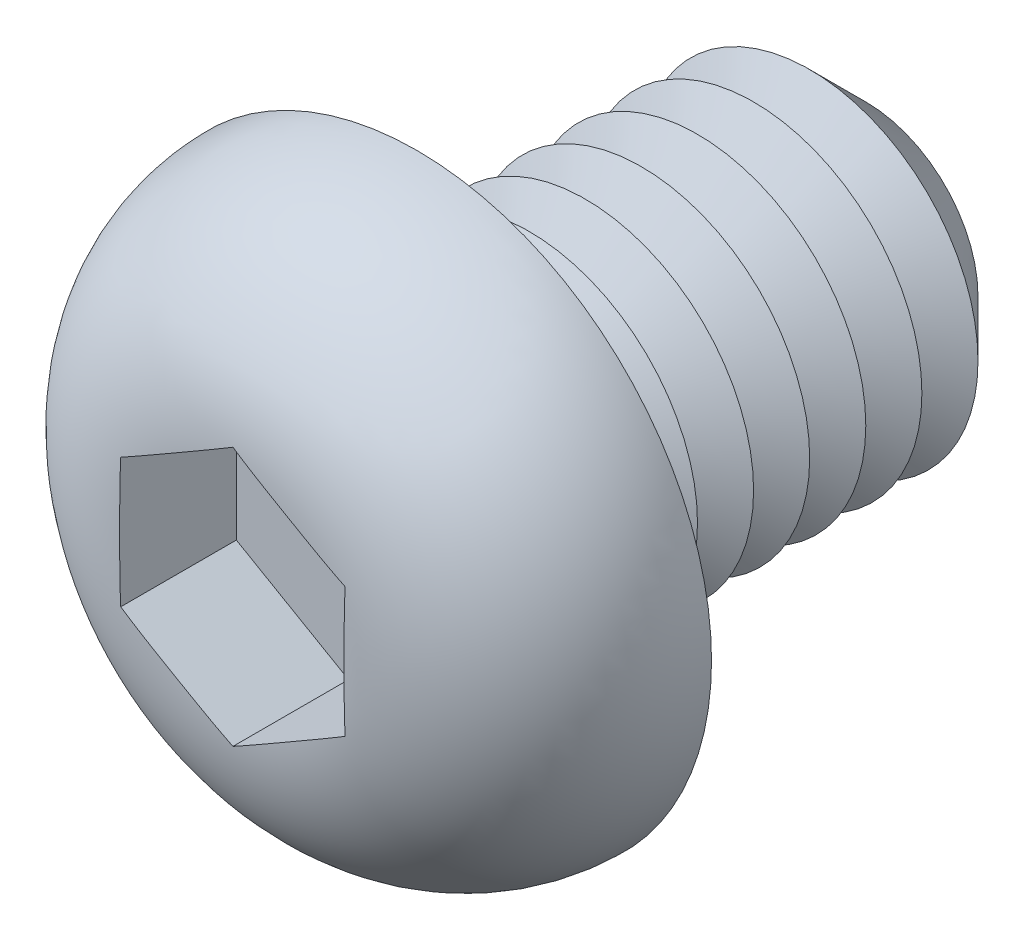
ISO-10303-21;
HEADER;
FILE_DESCRIPTION(('STEP AP214'),'2;1');
FILE_NAME('part.step','',(''),(''),'','','');
FILE_SCHEMA(('AUTOMOTIVE_DESIGN { 1 0 10303 214 1 1 1 1 }'));
ENDSEC;
DATA;
#1=APPLICATION_CONTEXT('core data for automotive mechanical design processes');
#2=APPLICATION_PROTOCOL_DEFINITION('international standard','automotive_design',2000,#1);
#3=PRODUCT_CONTEXT('',#1,'mechanical');
#4=PRODUCT('Part','Part','',(#3));
#5=PRODUCT_RELATED_PRODUCT_CATEGORY('part','',(#4));
#6=PRODUCT_DEFINITION_FORMATION('','',#4);
#7=PRODUCT_DEFINITION_CONTEXT('part definition',#1,'design');
#8=PRODUCT_DEFINITION('design','',#6,#7);
#9=PRODUCT_DEFINITION_SHAPE('','',#8);
#10=(LENGTH_UNIT() NAMED_UNIT(*) SI_UNIT(.MILLI.,.METRE.));
#11=(NAMED_UNIT(*) PLANE_ANGLE_UNIT() SI_UNIT($,.RADIAN.));
#12=(NAMED_UNIT(*) SI_UNIT($,.STERADIAN.) SOLID_ANGLE_UNIT());
#13=UNCERTAINTY_MEASURE_WITH_UNIT(LENGTH_MEASURE(1.E-05),#10,'distance_accuracy_value','');
#14=(GEOMETRIC_REPRESENTATION_CONTEXT(3) GLOBAL_UNCERTAINTY_ASSIGNED_CONTEXT((#13)) GLOBAL_UNIT_ASSIGNED_CONTEXT((#10,
#11,#12)) REPRESENTATION_CONTEXT('',''));
#15=CARTESIAN_POINT('',(0.,0.,0.));
#16=DIRECTION('',(0.,0.,1.));
#17=DIRECTION('',(1.,0.,0.));
#18=AXIS2_PLACEMENT_3D('',#15,#16,#17);
#19=CARTESIAN_POINT('',(0.,0.,-8.));
#20=DIRECTION('',(0.,0.,1.));
#21=DIRECTION('',(1.,0.,0.));
#22=AXIS2_PLACEMENT_3D('',#19,#20,#21);
#23=CYLINDRICAL_SURFACE('',#22,3.);
#24=CARTESIAN_POINT('',(0.,0.,-0.5));
#25=DIRECTION('',(0.,0.,1.));
#26=DIRECTION('',(1.,0.,0.));
#27=AXIS2_PLACEMENT_3D('',#24,#25,#26);
#28=CIRCLE('',#27,3.);
#29=CARTESIAN_POINT('',(3.,0.,-0.5));
#30=VERTEX_POINT('',#29);
#31=EDGE_CURVE('E48',#30,#30,#28,.F.);
#32=ORIENTED_EDGE('',*,*,#31,.T.);
#33=EDGE_LOOP('',(#32));
#34=FACE_BOUND('',#33,.T.);
#35=CARTESIAN_POINT('',(0.,0.,-1.));
#36=DIRECTION('',(0.,0.,1.));
#37=DIRECTION('',(1.,0.,0.));
#38=AXIS2_PLACEMENT_3D('',#35,#36,#37);
#39=CIRCLE('',#38,3.);
#40=CARTESIAN_POINT('',(3.,0.,-1.));
#41=VERTEX_POINT('',#40);
#42=EDGE_CURVE('E118',#41,#41,#39,.T.);
#43=ORIENTED_EDGE('',*,*,#42,.T.);
#44=EDGE_LOOP('',(#43));
#45=FACE_BOUND('',#44,.T.);
#46=ADVANCED_FACE('F39',(#34,#45),#23,.T.);
#47=CARTESIAN_POINT('',(0.,5.25,0.));
#48=DIRECTION('',(0.,0.,1.));
#49=DIRECTION('',(1.,0.,0.));
#50=AXIS2_PLACEMENT_3D('',#47,#48,#49);
#51=PLANE('',#50);
#52=CARTESIAN_POINT('',(0.,0.,0.));
#53=DIRECTION('',(0.,0.,1.));
#54=DIRECTION('',(1.,0.,0.));
#55=AXIS2_PLACEMENT_3D('',#52,#53,#54);
#56=CIRCLE('',#55,3.5);
#57=CARTESIAN_POINT('',(3.5,0.,0.));
#58=VERTEX_POINT('',#57);
#59=EDGE_CURVE('E11',#58,#58,#56,.T.);
#60=ORIENTED_EDGE('',*,*,#59,.T.);
#61=EDGE_LOOP('',(#60));
#62=FACE_BOUND('',#61,.T.);
#63=CARTESIAN_POINT('',(0.,0.,0.));
#64=DIRECTION('',(0.,0.,1.));
#65=DIRECTION('',(1.,0.,0.));
#66=AXIS2_PLACEMENT_3D('',#63,#64,#65);
#67=CIRCLE('',#66,5.25);
#68=CARTESIAN_POINT('',(5.25,0.,0.));
#69=VERTEX_POINT('',#68);
#70=EDGE_CURVE('E142',#69,#69,#67,.T.);
#71=ORIENTED_EDGE('',*,*,#70,.F.);
#72=EDGE_LOOP('',(#71));
#73=FACE_BOUND('',#72,.T.);
#74=ADVANCED_FACE('F219',(#62,#73),#51,.F.);
#75=CARTESIAN_POINT('',(0.,0.,0.));
#76=DIRECTION('',(0.,0.,1.));
#77=DIRECTION('',(1.,0.,0.));
#78=AXIS2_PLACEMENT_3D('',#75,#76,#77);
#79=DEGENERATE_TOROIDAL_SURFACE('',#78,1.95,3.3,.T.);
#80=CARTESIAN_POINT('',(-2.0002,1.15458506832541,3.28035788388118));
#81=CARTESIAN_POINT('',(-1.91691288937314,1.20267090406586,3.28561413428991));
#82=CARTESIAN_POINT('',(-1.83357497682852,1.25078607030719,3.2893341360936));
#83=CARTESIAN_POINT('',(-1.66686712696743,1.34703489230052,3.29467873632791));
#84=CARTESIAN_POINT('',(-1.58349720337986,1.39516854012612,3.29630387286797));
#85=CARTESIAN_POINT('',(-1.4167768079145,1.49142460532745,3.29843721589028));
#86=CARTESIAN_POINT('',(-1.33342633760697,1.53954702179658,3.29894575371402));
#87=CARTESIAN_POINT('',(-1.16671724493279,1.63579656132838,3.29953775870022));
#88=CARTESIAN_POINT('',(-1.0833586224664,1.68392368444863,3.29962119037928));
#89=CARTESIAN_POINT('',(-0.916641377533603,1.78017793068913,3.29962119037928));
#90=CARTESIAN_POINT('',(-0.833282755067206,1.82830505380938,3.29953775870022));
#91=CARTESIAN_POINT('',(-0.666573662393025,1.92455459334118,3.29894575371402));
#92=CARTESIAN_POINT('',(-0.5832231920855,1.97267700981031,3.29843721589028));
#93=CARTESIAN_POINT('',(-0.416502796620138,2.06893307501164,3.29630387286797));
#94=CARTESIAN_POINT('',(-0.333132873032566,2.11706672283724,3.29467873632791));
#95=CARTESIAN_POINT('',(-0.166425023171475,2.21331554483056,3.2893341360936));
#96=CARTESIAN_POINT('',(-0.0830871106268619,2.2614307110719,3.28561413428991));
#97=CARTESIAN_POINT('',(0.000200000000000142,2.30951654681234,3.28035788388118));
#98=B_SPLINE_CURVE_WITH_KNOTS('',3,(#80,#81,#82,#83,#84,#85,#86,#87,#88,#89,#90,#91,#92,#93,#94,
#95,#96,#97),.UNSPECIFIED.,.F.,.F.,(4,2,2,2,2,2,2,2,4),(0.,0.288898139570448,0.577722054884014,
0.866460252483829,1.15522255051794,1.44398484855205,1.73272304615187,2.02154696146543,
2.31044510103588),.UNSPECIFIED.);
#99=CARTESIAN_POINT('',(-2.,1.15470053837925,3.28037053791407));
#100=VERTEX_POINT('',#99);
#101=CARTESIAN_POINT('',(0.,2.3094010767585,3.28037053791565));
#102=VERTEX_POINT('',#101);
#103=EDGE_CURVE('E159',#100,#102,#98,.T.);
#104=ORIENTED_EDGE('',*,*,#103,.T.);
#105=CARTESIAN_POINT('',(-0.000199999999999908,2.30951654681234,3.28035788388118));
#106=CARTESIAN_POINT('',(0.0830871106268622,2.2614307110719,3.28561413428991));
#107=CARTESIAN_POINT('',(0.166425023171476,2.21331554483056,3.2893341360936));
#108=CARTESIAN_POINT('',(0.333132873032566,2.11706672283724,3.29467873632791));
#109=CARTESIAN_POINT('',(0.416502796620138,2.06893307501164,3.29630387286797));
#110=CARTESIAN_POINT('',(0.5832231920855,1.97267700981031,3.29843721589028));
#111=CARTESIAN_POINT('',(0.666573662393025,1.92455459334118,3.29894575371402));
#112=CARTESIAN_POINT('',(0.833282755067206,1.82830505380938,3.29953775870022));
#113=CARTESIAN_POINT('',(0.916641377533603,1.78017793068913,3.29962119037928));
#114=CARTESIAN_POINT('',(1.0833586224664,1.68392368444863,3.29962119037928));
#115=CARTESIAN_POINT('',(1.16671724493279,1.63579656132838,3.29953775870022));
#116=CARTESIAN_POINT('',(1.33342633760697,1.53954702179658,3.29894575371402));
#117=CARTESIAN_POINT('',(1.4167768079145,1.49142460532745,3.29843721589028));
#118=CARTESIAN_POINT('',(1.58349720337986,1.39516854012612,3.29630387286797));
#119=CARTESIAN_POINT('',(1.66686712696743,1.34703489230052,3.29467873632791));
#120=CARTESIAN_POINT('',(1.83357497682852,1.25078607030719,3.2893341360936));
#121=CARTESIAN_POINT('',(1.91691288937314,1.20267090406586,3.28561413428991));
#122=CARTESIAN_POINT('',(2.0002,1.15458506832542,3.28035788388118));
#123=B_SPLINE_CURVE_WITH_KNOTS('',3,(#105,#106,#107,#108,#109,#110,#111,#112,#113,#114,#115,
#116,#117,#118,#119,#120,#121,#122),.UNSPECIFIED.,.F.,.F.,(4,2,2,2,2,2,2,2,4),(0.,
0.288898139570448,0.577722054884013,0.866460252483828,1.15522255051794,1.44398484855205,
1.73272304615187,2.02154696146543,2.31044510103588),.UNSPECIFIED.);
#124=CARTESIAN_POINT('',(2.,1.15470053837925,3.28037053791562));
#125=VERTEX_POINT('',#124);
#126=EDGE_CURVE('E98',#102,#125,#123,.T.);
#127=ORIENTED_EDGE('',*,*,#126,.T.);
#128=CARTESIAN_POINT('',(2.,0.,3.29962119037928));
#129=CARTESIAN_POINT('',(2.,-0.0837769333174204,3.29962202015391));
#130=CARTESIAN_POINT('',(2.,-0.16755385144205,3.29955399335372));
#131=CARTESIAN_POINT('',(2.,-0.335108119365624,3.29913665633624));
#132=CARTESIAN_POINT('',(2.,-0.418885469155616,3.29878734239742));
#133=CARTESIAN_POINT('',(2.,-0.586474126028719,3.29739645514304));
#134=CARTESIAN_POINT('',(2.,-0.670285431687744,3.29635457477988));
#135=CARTESIAN_POINT('',(2.,-0.83788107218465,3.29299045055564));
#136=CARTESIAN_POINT('',(2.,-0.921665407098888,3.29066821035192));
#137=CARTESIAN_POINT('',(2.,-1.1722454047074,3.2807858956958));
#138=CARTESIAN_POINT('',(2.,-1.33895832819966,3.27031526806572));
#139=CARTESIAN_POINT('',(2.,-1.67103623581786,3.23635494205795));
#140=CARTESIAN_POINT('',(2.,-1.83640244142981,3.21287879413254));
#141=CARTESIAN_POINT('',(2.,-2.10344176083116,3.16074182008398));
#142=CARTESIAN_POINT('',(2.,-2.2061099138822,3.13718731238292));
#143=CARTESIAN_POINT('',(2.,-2.40948794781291,3.08263206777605));
#144=CARTESIAN_POINT('',(2.,-2.51019754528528,3.05163026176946));
#145=CARTESIAN_POINT('',(2.,-2.70894468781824,2.98167613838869));
#146=CARTESIAN_POINT('',(2.,-2.80697949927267,2.94271600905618));
#147=CARTESIAN_POINT('',(2.,-2.9994014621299,2.85662314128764));
#148=CARTESIAN_POINT('',(2.,-3.09378880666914,2.80949083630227));
#149=CARTESIAN_POINT('',(2.,-3.27874879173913,2.70660110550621));
#150=CARTESIAN_POINT('',(2.,-3.36928473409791,2.6507774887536));
#151=CARTESIAN_POINT('',(2.,-3.54476824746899,2.53095107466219));
#152=CARTESIAN_POINT('',(2.,-3.6297163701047,2.46694908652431));
#153=CARTESIAN_POINT('',(2.,-3.79309021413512,2.33110056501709));
#154=CARTESIAN_POINT('',(2.,-3.87151694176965,2.25925524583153));
#155=CARTESIAN_POINT('',(2.,-4.02093628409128,2.10826339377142));
#156=CARTESIAN_POINT('',(2.,-4.09192987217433,2.02911781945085));
#157=CARTESIAN_POINT('',(2.,-4.27732278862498,1.8003635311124));
#158=CARTESIAN_POINT('',(2.,-4.38297261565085,1.64348590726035));
#159=CARTESIAN_POINT('',(2.,-4.564185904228,1.31336862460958));
#160=CARTESIAN_POINT('',(2.,-4.63976443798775,1.14013721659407));
#161=CARTESIAN_POINT('',(2.,-4.75417820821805,0.794488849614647));
#162=CARTESIAN_POINT('',(2.,-4.79509243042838,0.622758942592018));
#163=CARTESIAN_POINT('',(2.,-4.84679751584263,0.274828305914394));
#164=CARTESIAN_POINT('',(2.,-4.85759267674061,0.0986282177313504));
#165=CARTESIAN_POINT('',(2.,-4.8487955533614,-0.249157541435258));
#166=CARTESIAN_POINT('',(2.,-4.82985906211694,-0.420760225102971));
#167=CARTESIAN_POINT('',(2.,-4.76345103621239,-0.758322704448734));
#168=CARTESIAN_POINT('',(2.,-4.71598351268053,-0.924283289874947));
#169=CARTESIAN_POINT('',(2.,-4.59404942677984,-1.24604183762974));
#170=CARTESIAN_POINT('',(2.,-4.51956988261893,-1.40183487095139));
#171=CARTESIAN_POINT('',(2.,-4.34600859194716,-1.6990817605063));
#172=CARTESIAN_POINT('',(2.,-4.24691988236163,-1.84053154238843));
#173=CARTESIAN_POINT('',(2.,-4.02493220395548,-2.10847549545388));
#174=CARTESIAN_POINT('',(2.,-3.90156532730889,-2.23458080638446));
#175=CARTESIAN_POINT('',(2.,-3.63636218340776,-2.46550695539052));
#176=CARTESIAN_POINT('',(2.,-3.49453117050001,-2.57033382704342));
#177=CARTESIAN_POINT('',(2.,-3.26713798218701,-2.7130834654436));
#178=CARTESIAN_POINT('',(2.,-3.18660091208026,-2.75923686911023));
#179=CARTESIAN_POINT('',(2.,-3.02216370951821,-2.84520816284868));
#180=CARTESIAN_POINT('',(2.,-2.93826250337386,-2.88502400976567));
#181=CARTESIAN_POINT('',(2.,-2.76779132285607,-2.95832456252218));
#182=CARTESIAN_POINT('',(2.,-2.68122238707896,-2.99181169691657));
#183=CARTESIAN_POINT('',(2.,-2.50604626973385,-3.05263810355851));
#184=CARTESIAN_POINT('',(2.,-2.41744088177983,-3.07998257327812));
#185=CARTESIAN_POINT('',(2.,-2.20396420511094,-3.13835394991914));
#186=CARTESIAN_POINT('',(2.,-2.0783565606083,-3.16669536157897));
#187=CARTESIAN_POINT('',(2.,-1.82529007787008,-3.2134938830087));
#188=CARTESIAN_POINT('',(2.,-1.69783012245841,-3.23194474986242));
#189=CARTESIAN_POINT('',(2.,-1.4414959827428,-3.26083645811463));
#190=CARTESIAN_POINT('',(2.,-1.31261808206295,-3.27124272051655));
#191=CARTESIAN_POINT('',(2.,-1.0545684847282,-3.28623769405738));
#192=CARTESIAN_POINT('',(2.,-0.925396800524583,-3.29082664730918));
#193=CARTESIAN_POINT('',(2.,-0.665550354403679,-3.29674923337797));
#194=CARTESIAN_POINT('',(2.,-0.534874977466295,-3.29804579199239));
#195=CARTESIAN_POINT('',(2.,-0.273526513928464,-3.29947536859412));
#196=CARTESIAN_POINT('',(2.,-0.142853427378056,-3.29960842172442));
#197=CARTESIAN_POINT('',(2.,0.118243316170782,-3.29963281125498));
#198=CARTESIAN_POINT('',(2.,0.24866697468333,-3.29952460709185));
#199=CARTESIAN_POINT('',(2.,0.509509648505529,-3.29825409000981));
#200=CARTESIAN_POINT('',(2.,0.63992866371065,-3.29709183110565));
#201=CARTESIAN_POINT('',(2.,0.831730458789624,-3.29304171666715));
#202=CARTESIAN_POINT('',(2.,0.893136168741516,-3.29139197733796));
#203=CARTESIAN_POINT('',(2.,1.0159128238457,-3.28711504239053));
#204=CARTESIAN_POINT('',(2.,1.07728376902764,-3.28448784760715));
#205=CARTESIAN_POINT('',(2.,1.26131335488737,-3.27473407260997));
#206=CARTESIAN_POINT('',(2.,1.38388698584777,-3.26573532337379));
#207=CARTESIAN_POINT('',(2.,1.627501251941,-3.24079239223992));
#208=CARTESIAN_POINT('',(2.,1.74854662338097,-3.22489680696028));
#209=CARTESIAN_POINT('',(2.,1.98924449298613,-3.18452451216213));
#210=CARTESIAN_POINT('',(2.,2.10889688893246,-3.16004717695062));
#211=CARTESIAN_POINT('',(2.,2.34827145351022,-3.10067973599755));
#212=CARTESIAN_POINT('',(2.,2.46794336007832,-3.06558373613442));
#213=CARTESIAN_POINT('',(2.,2.70350765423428,-2.98433995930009));
#214=CARTESIAN_POINT('',(2.,2.81940009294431,-2.93819233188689));
#215=CARTESIAN_POINT('',(2.,3.0462872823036,-2.83430045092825));
#216=CARTESIAN_POINT('',(2.,3.157267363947,-2.77652399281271));
#217=CARTESIAN_POINT('',(2.,3.37244069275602,-2.64945989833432));
#218=CARTESIAN_POINT('',(2.,3.47663511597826,-2.58017426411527));
#219=CARTESIAN_POINT('',(2.,3.66184410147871,-2.44158969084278));
#220=CARTESIAN_POINT('',(2.,3.74400419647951,-2.37381785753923));
#221=CARTESIAN_POINT('',(2.,3.90136233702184,-2.23063102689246));
#222=CARTESIAN_POINT('',(2.,3.9765614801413,-2.1552172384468));
#223=CARTESIAN_POINT('',(2.,4.11902811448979,-1.99742327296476));
#224=CARTESIAN_POINT('',(2.,4.18630715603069,-1.91505354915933));
#225=CARTESIAN_POINT('',(2.,4.31224227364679,-1.74401295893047));
#226=CARTESIAN_POINT('',(2.,4.37089943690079,-1.65534288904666));
#227=CARTESIAN_POINT('',(2.,4.51742320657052,-1.40720395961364));
#228=CARTESIAN_POINT('',(2.,4.59632371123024,-1.24230503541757));
#229=CARTESIAN_POINT('',(2.,4.72377654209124,-0.901269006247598));
#230=CARTESIAN_POINT('',(2.,4.77233626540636,-0.725134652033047));
#231=CARTESIAN_POINT('',(2.,4.83594291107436,-0.375162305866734));
#232=CARTESIAN_POINT('',(2.,4.85240855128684,-0.201581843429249));
#233=CARTESIAN_POINT('',(2.,4.85558073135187,0.145835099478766));
#234=CARTESIAN_POINT('',(2.,4.8422910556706,0.319671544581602));
#235=CARTESIAN_POINT('',(2.,4.78674180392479,0.6605393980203));
#236=CARTESIAN_POINT('',(2.,4.74482430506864,0.827626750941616));
#237=CARTESIAN_POINT('',(2.,4.63375789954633,1.15246461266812));
#238=CARTESIAN_POINT('',(2.,4.56461058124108,1.31021566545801));
#239=CARTESIAN_POINT('',(2.,4.40063624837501,1.61344814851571));
#240=CARTESIAN_POINT('',(2.,4.30559842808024,1.75881539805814));
#241=CARTESIAN_POINT('',(2.,4.09315528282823,2.03216183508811));
#242=CARTESIAN_POINT('',(2.,3.97574503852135,2.16013718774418));
#243=CARTESIAN_POINT('',(2.,3.71810418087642,2.39975271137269));
#244=CARTESIAN_POINT('',(2.,3.57725563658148,2.51072635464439));
#245=CARTESIAN_POINT('',(2.,3.28005668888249,2.70933274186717));
#246=CARTESIAN_POINT('',(2.,3.12370896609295,2.79696951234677));
#247=CARTESIAN_POINT('',(2.,2.85462284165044,2.92305372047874));
#248=CARTESIAN_POINT('',(2.,2.74490899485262,2.96813077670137));
#249=CARTESIAN_POINT('',(2.,2.52184151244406,3.04824715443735));
#250=CARTESIAN_POINT('',(2.,2.40848685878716,3.08328364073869));
#251=CARTESIAN_POINT('',(2.,2.17918323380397,3.14397693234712));
#252=CARTESIAN_POINT('',(2.,2.06323128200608,3.16962230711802));
#253=CARTESIAN_POINT('',(2.,1.82982653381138,3.21251895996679));
#254=CARTESIAN_POINT('',(2.,1.71237385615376,3.229770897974));
#255=CARTESIAN_POINT('',(2.,1.46252543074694,3.2589582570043));
#256=CARTESIAN_POINT('',(2.,1.3300298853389,3.27000580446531));
#257=CARTESIAN_POINT('',(2.,1.0646774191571,3.28585371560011));
#258=CARTESIAN_POINT('',(2.,0.931820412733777,3.29065244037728));
#259=CARTESIAN_POINT('',(2.,0.665789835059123,3.29677132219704));
#260=CARTESIAN_POINT('',(2.,0.532616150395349,3.29808470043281));
#261=CARTESIAN_POINT('',(2.,0.332868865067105,3.29913679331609));
#262=CARTESIAN_POINT('',(2.,0.266295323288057,3.2993345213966));
#263=CARTESIAN_POINT('',(2.,0.133147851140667,3.29957639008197));
#264=CARTESIAN_POINT('',(2.,0.0665739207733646,3.29962053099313));
#265=CARTESIAN_POINT('',(2.,0.,3.29962119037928));
#266=B_SPLINE_CURVE_WITH_KNOTS('',3,(#128,#129,#130,#131,#132,#133,#134,#135,#136,#137,#138,
#139,#140,#141,#142,#143,#144,#145,#146,#147,#148,#149,#150,#151,#152,#153,#154,#155,#156,#157,
#158,#159,#160,#161,#162,#163,#164,#165,#166,#167,#168,#169,#170,#171,#172,#173,#174,#175,#176,
#177,#178,#179,#180,#181,#182,#183,#184,#185,#186,#187,#188,#189,#190,#191,#192,#193,#194,#195,
#196,#197,#198,#199,#200,#201,#202,#203,#204,#205,#206,#207,#208,#209,#210,#211,#212,#213,#214,
#215,#216,#217,#218,#219,#220,#221,#222,#223,#224,#225,#226,#227,#228,#229,#230,#231,#232,#233,
#234,#235,#236,#237,#238,#239,#240,#241,#242,#243,#244,#245,#246,#247,#248,#249,#250,#251,#252,
#253,#254,#255,#256,#257,#258,#259,#260,#261,#262,#263,#264,#265),.UNSPECIFIED.,.T.,.F.,(4,2,2,
2,2,2,2,2,2,2,2,2,2,2,2,2,2,2,2,2,2,2,2,2,2,2,2,2,2,2,2,2,2,2,2,2,2,2,2,2,2,2,2,2,2,2,2,2,2,2,2,
2,2,2,2,2,2,2,2,2,2,2,2,2,2,2,2,2,4),(0.,0.251330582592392,0.502664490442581,0.754109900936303,
1.00555459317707,1.50637447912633,2.00667353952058,2.32243701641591,2.63824585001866,
2.95436618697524,3.27046976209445,3.58911045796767,3.90771965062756,4.22627959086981,
4.5447977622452,5.10896009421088,5.67283930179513,6.19985685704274,6.72679920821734,
7.24228104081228,7.75769041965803,8.27334782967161,8.78915130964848,9.3160918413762,
9.84288274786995,10.1211212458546,10.3994492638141,10.6776702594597,10.9556549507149,
11.3414617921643,11.727511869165,12.1152122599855,12.5028965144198,12.8949273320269,
13.2869463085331,13.6782193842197,14.0694724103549,14.2537488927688,14.4380252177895,
14.8065831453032,15.1725852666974,15.5386140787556,15.9122523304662,16.28588552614,
16.6605680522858,17.0351854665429,17.3542226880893,17.6732095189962,17.9917252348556,
18.3102007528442,18.8555909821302,19.4008481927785,19.9214008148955,20.4418872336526,
20.9562606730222,21.4706041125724,21.9892675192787,22.5080451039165,23.0436926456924,
23.5792477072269,23.9346277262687,24.2901079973,24.6460195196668,25.0019030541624,
25.4005476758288,25.7992968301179,26.1988209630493,26.3985429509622,26.5982645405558),.UNSPECIFIED.);
#267=CARTESIAN_POINT('',(2.,-1.15470053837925,3.28037053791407));
#268=VERTEX_POINT('',#267);
#269=EDGE_CURVE('E63',#125,#268,#266,.T.);
#270=ORIENTED_EDGE('',*,*,#269,.T.);
#271=CARTESIAN_POINT('',(2.0002,-1.15458506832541,3.28035788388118));
#272=CARTESIAN_POINT('',(1.91691288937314,-1.20267090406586,3.28561413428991));
#273=CARTESIAN_POINT('',(1.83357497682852,-1.25078607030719,3.2893341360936));
#274=CARTESIAN_POINT('',(1.66686712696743,-1.34703489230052,3.29467873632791));
#275=CARTESIAN_POINT('',(1.58349720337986,-1.39516854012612,3.29630387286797));
#276=CARTESIAN_POINT('',(1.4167768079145,-1.49142460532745,3.29843721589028));
#277=CARTESIAN_POINT('',(1.33342633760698,-1.53954702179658,3.29894575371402));
#278=CARTESIAN_POINT('',(1.16671724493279,-1.63579656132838,3.29953775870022));
#279=CARTESIAN_POINT('',(1.0833586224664,-1.68392368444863,3.29962119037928));
#280=CARTESIAN_POINT('',(0.916641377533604,-1.78017793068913,3.29962119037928));
#281=CARTESIAN_POINT('',(0.833282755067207,-1.82830505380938,3.29953775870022));
#282=CARTESIAN_POINT('',(0.666573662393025,-1.92455459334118,3.29894575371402));
#283=CARTESIAN_POINT('',(0.5832231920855,-1.97267700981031,3.29843721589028));
#284=CARTESIAN_POINT('',(0.416502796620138,-2.06893307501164,3.29630387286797));
#285=CARTESIAN_POINT('',(0.333132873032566,-2.11706672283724,3.29467873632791));
#286=CARTESIAN_POINT('',(0.166425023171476,-2.21331554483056,3.2893341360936));
#287=CARTESIAN_POINT('',(0.0830871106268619,-2.2614307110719,3.28561413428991));
#288=CARTESIAN_POINT('',(-0.000199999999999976,-2.30951654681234,3.28035788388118));
#289=B_SPLINE_CURVE_WITH_KNOTS('',3,(#271,#272,#273,#274,#275,#276,#277,#278,#279,#280,#281,
#282,#283,#284,#285,#286,#287,#288),.UNSPECIFIED.,.F.,.F.,(4,2,2,2,2,2,2,2,4),(0.,
0.288898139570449,0.577722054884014,0.866460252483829,1.15522255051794,1.44398484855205,
1.73272304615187,2.02154696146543,2.31044510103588),.UNSPECIFIED.);
#290=CARTESIAN_POINT('',(0.,-2.3094010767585,3.28037053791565));
#291=VERTEX_POINT('',#290);
#292=EDGE_CURVE('E240',#268,#291,#289,.T.);
#293=ORIENTED_EDGE('',*,*,#292,.T.);
#294=CARTESIAN_POINT('',(0.000200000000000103,-2.30951654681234,3.28035788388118));
#295=CARTESIAN_POINT('',(-0.0830871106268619,-2.2614307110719,3.28561413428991));
#296=CARTESIAN_POINT('',(-0.166425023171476,-2.21331554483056,3.2893341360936));
#297=CARTESIAN_POINT('',(-0.333132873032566,-2.11706672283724,3.29467873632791));
#298=CARTESIAN_POINT('',(-0.416502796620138,-2.06893307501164,3.29630387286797));
#299=CARTESIAN_POINT('',(-0.5832231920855,-1.97267700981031,3.29843721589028));
#300=CARTESIAN_POINT('',(-0.666573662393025,-1.92455459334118,3.29894575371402));
#301=CARTESIAN_POINT('',(-0.833282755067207,-1.82830505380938,3.29953775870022));
#302=CARTESIAN_POINT('',(-0.916641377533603,-1.78017793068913,3.29962119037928));
#303=CARTESIAN_POINT('',(-1.0833586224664,-1.68392368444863,3.29962119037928));
#304=CARTESIAN_POINT('',(-1.16671724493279,-1.63579656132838,3.29953775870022));
#305=CARTESIAN_POINT('',(-1.33342633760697,-1.53954702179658,3.29894575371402));
#306=CARTESIAN_POINT('',(-1.4167768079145,-1.49142460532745,3.29843721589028));
#307=CARTESIAN_POINT('',(-1.58349720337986,-1.39516854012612,3.29630387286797));
#308=CARTESIAN_POINT('',(-1.66686712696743,-1.34703489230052,3.29467873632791));
#309=CARTESIAN_POINT('',(-1.83357497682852,-1.25078607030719,3.2893341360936));
#310=CARTESIAN_POINT('',(-1.91691288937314,-1.20267090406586,3.28561413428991));
#311=CARTESIAN_POINT('',(-2.0002,-1.15458506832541,3.28035788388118));
#312=B_SPLINE_CURVE_WITH_KNOTS('',3,(#294,#295,#296,#297,#298,#299,#300,#301,#302,#303,#304,
#305,#306,#307,#308,#309,#310,#311),.UNSPECIFIED.,.F.,.F.,(4,2,2,2,2,2,2,2,4),(0.,
0.288898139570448,0.577722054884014,0.866460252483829,1.15522255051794,1.44398484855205,
1.73272304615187,2.02154696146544,2.31044510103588),.UNSPECIFIED.);
#313=CARTESIAN_POINT('',(-2.,-1.15470053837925,3.28037053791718));
#314=VERTEX_POINT('',#313);
#315=EDGE_CURVE('E246',#291,#314,#312,.T.);
#316=ORIENTED_EDGE('',*,*,#315,.T.);
#317=CARTESIAN_POINT('',(-2.,0.,3.29962119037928));
#318=CARTESIAN_POINT('',(-2.,0.0837769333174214,3.29962202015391));
#319=CARTESIAN_POINT('',(-2.,0.167553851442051,3.29955399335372));
#320=CARTESIAN_POINT('',(-2.,0.335108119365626,3.29913665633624));
#321=CARTESIAN_POINT('',(-2.,0.418885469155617,3.29878734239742));
#322=CARTESIAN_POINT('',(-2.,0.58647412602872,3.29739645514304));
#323=CARTESIAN_POINT('',(-2.,0.670285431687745,3.29635457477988));
#324=CARTESIAN_POINT('',(-2.,0.837881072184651,3.29299045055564));
#325=CARTESIAN_POINT('',(-2.,0.921665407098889,3.29066821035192));
#326=CARTESIAN_POINT('',(-2.,1.1722454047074,3.2807858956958));
#327=CARTESIAN_POINT('',(-2.,1.33895832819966,3.27031526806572));
#328=CARTESIAN_POINT('',(-2.,1.67103623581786,3.23635494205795));
#329=CARTESIAN_POINT('',(-2.,1.83640244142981,3.21287879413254));
#330=CARTESIAN_POINT('',(-2.,2.10344176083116,3.16074182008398));
#331=CARTESIAN_POINT('',(-2.,2.2061099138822,3.13718731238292));
#332=CARTESIAN_POINT('',(-2.,2.40948794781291,3.08263206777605));
#333=CARTESIAN_POINT('',(-2.,2.51019754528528,3.05163026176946));
#334=CARTESIAN_POINT('',(-2.,2.70894468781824,2.98167613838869));
#335=CARTESIAN_POINT('',(-2.,2.80697949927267,2.94271600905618));
#336=CARTESIAN_POINT('',(-2.,2.9994014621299,2.85662314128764));
#337=CARTESIAN_POINT('',(-2.,3.09378880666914,2.80949083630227));
#338=CARTESIAN_POINT('',(-2.,3.27874879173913,2.70660110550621));
#339=CARTESIAN_POINT('',(-2.,3.36928473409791,2.6507774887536));
#340=CARTESIAN_POINT('',(-2.,3.54476824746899,2.53095107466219));
#341=CARTESIAN_POINT('',(-2.,3.6297163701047,2.46694908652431));
#342=CARTESIAN_POINT('',(-2.,3.79309021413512,2.33110056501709));
#343=CARTESIAN_POINT('',(-2.,3.87151694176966,2.25925524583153));
#344=CARTESIAN_POINT('',(-2.,4.02093628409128,2.10826339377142));
#345=CARTESIAN_POINT('',(-2.,4.09192987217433,2.02911781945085));
#346=CARTESIAN_POINT('',(-2.,4.27732278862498,1.8003635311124));
#347=CARTESIAN_POINT('',(-2.,4.38297261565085,1.64348590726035));
#348=CARTESIAN_POINT('',(-2.,4.564185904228,1.31336862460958));
#349=CARTESIAN_POINT('',(-2.,4.63976443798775,1.14013721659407));
#350=CARTESIAN_POINT('',(-2.,4.75417820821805,0.794488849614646));
#351=CARTESIAN_POINT('',(-2.,4.79509243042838,0.622758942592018));
#352=CARTESIAN_POINT('',(-2.,4.84679751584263,0.274828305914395));
#353=CARTESIAN_POINT('',(-2.,4.85759267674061,0.0986282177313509));
#354=CARTESIAN_POINT('',(-2.,4.8487955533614,-0.249157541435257));
#355=CARTESIAN_POINT('',(-2.,4.82985906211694,-0.420760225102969));
#356=CARTESIAN_POINT('',(-2.,4.76345103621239,-0.758322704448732));
#357=CARTESIAN_POINT('',(-2.,4.71598351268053,-0.924283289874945));
#358=CARTESIAN_POINT('',(-2.,4.59404942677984,-1.24604183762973));
#359=CARTESIAN_POINT('',(-2.,4.51956988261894,-1.40183487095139));
#360=CARTESIAN_POINT('',(-2.,4.34600859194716,-1.6990817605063));
#361=CARTESIAN_POINT('',(-2.,4.24691988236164,-1.84053154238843));
#362=CARTESIAN_POINT('',(-2.,4.02493220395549,-2.10847549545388));
#363=CARTESIAN_POINT('',(-2.,3.90156532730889,-2.23458080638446));
#364=CARTESIAN_POINT('',(-2.,3.63636218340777,-2.46550695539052));
#365=CARTESIAN_POINT('',(-2.,3.49453117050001,-2.57033382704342));
#366=CARTESIAN_POINT('',(-2.,3.26713798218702,-2.7130834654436));
#367=CARTESIAN_POINT('',(-2.,3.18660091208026,-2.75923686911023));
#368=CARTESIAN_POINT('',(-2.,3.02216370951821,-2.84520816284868));
#369=CARTESIAN_POINT('',(-2.,2.93826250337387,-2.88502400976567));
#370=CARTESIAN_POINT('',(-2.,2.76779132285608,-2.95832456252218));
#371=CARTESIAN_POINT('',(-2.,2.68122238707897,-2.99181169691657));
#372=CARTESIAN_POINT('',(-2.,2.50604626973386,-3.05263810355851));
#373=CARTESIAN_POINT('',(-2.,2.41744088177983,-3.07998257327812));
#374=CARTESIAN_POINT('',(-2.,2.20396420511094,-3.13835394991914));
#375=CARTESIAN_POINT('',(-2.,2.07835656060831,-3.16669536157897));
#376=CARTESIAN_POINT('',(-2.,1.82529007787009,-3.2134938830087));
#377=CARTESIAN_POINT('',(-2.,1.69783012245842,-3.23194474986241));
#378=CARTESIAN_POINT('',(-2.,1.44149598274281,-3.26083645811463));
#379=CARTESIAN_POINT('',(-2.,1.31261808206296,-3.27124272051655));
#380=CARTESIAN_POINT('',(-2.,1.05456848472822,-3.28623769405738));
#381=CARTESIAN_POINT('',(-2.,0.925396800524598,-3.29082664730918));
#382=CARTESIAN_POINT('',(-2.,0.665550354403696,-3.29674923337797));
#383=CARTESIAN_POINT('',(-2.,0.534874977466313,-3.29804579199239));
#384=CARTESIAN_POINT('',(-2.,0.273526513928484,-3.29947536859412));
#385=CARTESIAN_POINT('',(-2.,0.142853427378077,-3.29960842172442));
#386=CARTESIAN_POINT('',(-2.,-0.118243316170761,-3.29963281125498));
#387=CARTESIAN_POINT('',(-2.,-0.248666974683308,-3.29952460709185));
#388=CARTESIAN_POINT('',(-2.,-0.509509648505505,-3.29825409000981));
#389=CARTESIAN_POINT('',(-2.,-0.639928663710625,-3.29709183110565));
#390=CARTESIAN_POINT('',(-2.,-0.8317304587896,-3.29304171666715));
#391=CARTESIAN_POINT('',(-2.,-0.893136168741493,-3.29139197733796));
#392=CARTESIAN_POINT('',(-2.,-1.01591282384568,-3.28711504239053));
#393=CARTESIAN_POINT('',(-2.,-1.07728376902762,-3.28448784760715));
#394=CARTESIAN_POINT('',(-2.,-1.26131335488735,-3.27473407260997));
#395=CARTESIAN_POINT('',(-2.,-1.38388698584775,-3.2657353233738));
#396=CARTESIAN_POINT('',(-2.,-1.62750125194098,-3.24079239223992));
#397=CARTESIAN_POINT('',(-2.,-1.74854662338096,-3.22489680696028));
#398=CARTESIAN_POINT('',(-2.,-1.98924449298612,-3.18452451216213));
#399=CARTESIAN_POINT('',(-2.,-2.10889688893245,-3.16004717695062));
#400=CARTESIAN_POINT('',(-2.,-2.34827145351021,-3.10067973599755));
#401=CARTESIAN_POINT('',(-2.,-2.46794336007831,-3.06558373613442));
#402=CARTESIAN_POINT('',(-2.,-2.70350765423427,-2.98433995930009));
#403=CARTESIAN_POINT('',(-2.,-2.81940009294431,-2.93819233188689));
#404=CARTESIAN_POINT('',(-2.,-3.0462872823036,-2.83430045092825));
#405=CARTESIAN_POINT('',(-2.,-3.157267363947,-2.77652399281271));
#406=CARTESIAN_POINT('',(-2.,-3.37244069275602,-2.64945989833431));
#407=CARTESIAN_POINT('',(-2.,-3.47663511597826,-2.58017426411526));
#408=CARTESIAN_POINT('',(-2.,-3.66184410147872,-2.44158969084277));
#409=CARTESIAN_POINT('',(-2.,-3.74400419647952,-2.37381785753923));
#410=CARTESIAN_POINT('',(-2.,-3.90136233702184,-2.23063102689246));
#411=CARTESIAN_POINT('',(-2.,-3.9765614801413,-2.1552172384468));
#412=CARTESIAN_POINT('',(-2.,-4.11902811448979,-1.99742327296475));
#413=CARTESIAN_POINT('',(-2.,-4.1863071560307,-1.91505354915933));
#414=CARTESIAN_POINT('',(-2.,-4.31224227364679,-1.74401295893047));
#415=CARTESIAN_POINT('',(-2.,-4.37089943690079,-1.65534288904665));
#416=CARTESIAN_POINT('',(-2.,-4.51742320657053,-1.40720395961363));
#417=CARTESIAN_POINT('',(-2.,-4.59632371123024,-1.24230503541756));
#418=CARTESIAN_POINT('',(-2.,-4.72377654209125,-0.901269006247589));
#419=CARTESIAN_POINT('',(-2.,-4.77233626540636,-0.72513465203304));
#420=CARTESIAN_POINT('',(-2.,-4.83594291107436,-0.375162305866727));
#421=CARTESIAN_POINT('',(-2.,-4.85240855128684,-0.20158184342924));
#422=CARTESIAN_POINT('',(-2.,-4.85558073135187,0.145835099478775));
#423=CARTESIAN_POINT('',(-2.,-4.8422910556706,0.31967154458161));
#424=CARTESIAN_POINT('',(-2.,-4.78674180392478,0.660539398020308));
#425=CARTESIAN_POINT('',(-2.,-4.74482430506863,0.827626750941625));
#426=CARTESIAN_POINT('',(-2.,-4.63375789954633,1.15246461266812));
#427=CARTESIAN_POINT('',(-2.,-4.56461058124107,1.31021566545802));
#428=CARTESIAN_POINT('',(-2.,-4.40063624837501,1.61344814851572));
#429=CARTESIAN_POINT('',(-2.,-4.30559842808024,1.75881539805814));
#430=CARTESIAN_POINT('',(-2.,-4.09315528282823,2.03216183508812));
#431=CARTESIAN_POINT('',(-2.,-3.97574503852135,2.16013718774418));
#432=CARTESIAN_POINT('',(-2.,-3.71810418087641,2.3997527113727));
#433=CARTESIAN_POINT('',(-2.,-3.57725563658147,2.51072635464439));
#434=CARTESIAN_POINT('',(-2.,-3.28005668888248,2.70933274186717));
#435=CARTESIAN_POINT('',(-2.,-3.12370896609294,2.79696951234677));
#436=CARTESIAN_POINT('',(-2.,-2.85462284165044,2.92305372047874));
#437=CARTESIAN_POINT('',(-2.,-2.74490899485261,2.96813077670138));
#438=CARTESIAN_POINT('',(-2.,-2.52184151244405,3.04824715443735));
#439=CARTESIAN_POINT('',(-2.,-2.40848685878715,3.08328364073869));
#440=CARTESIAN_POINT('',(-2.,-2.17918323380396,3.14397693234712));
#441=CARTESIAN_POINT('',(-2.,-2.06323128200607,3.16962230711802));
#442=CARTESIAN_POINT('',(-2.,-1.82982653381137,3.21251895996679));
#443=CARTESIAN_POINT('',(-2.,-1.71237385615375,3.229770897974));
#444=CARTESIAN_POINT('',(-2.,-1.46252543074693,3.2589582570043));
#445=CARTESIAN_POINT('',(-2.,-1.33002988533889,3.27000580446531));
#446=CARTESIAN_POINT('',(-2.,-1.0646774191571,3.28585371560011));
#447=CARTESIAN_POINT('',(-2.,-0.931820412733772,3.29065244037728));
#448=CARTESIAN_POINT('',(-2.,-0.665789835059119,3.29677132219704));
#449=CARTESIAN_POINT('',(-2.,-0.532616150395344,3.29808470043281));
#450=CARTESIAN_POINT('',(-2.,-0.3328688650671,3.29913679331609));
#451=CARTESIAN_POINT('',(-2.,-0.266295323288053,3.2993345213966));
#452=CARTESIAN_POINT('',(-2.,-0.133147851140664,3.29957639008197));
#453=CARTESIAN_POINT('',(-2.,-0.0665739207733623,3.29962053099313));
#454=CARTESIAN_POINT('',(-2.,0.,3.29962119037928));
#455=B_SPLINE_CURVE_WITH_KNOTS('',3,(#317,#318,#319,#320,#321,#322,#323,#324,#325,#326,#327,
#328,#329,#330,#331,#332,#333,#334,#335,#336,#337,#338,#339,#340,#341,#342,#343,#344,#345,#346,
#347,#348,#349,#350,#351,#352,#353,#354,#355,#356,#357,#358,#359,#360,#361,#362,#363,#364,#365,
#366,#367,#368,#369,#370,#371,#372,#373,#374,#375,#376,#377,#378,#379,#380,#381,#382,#383,#384,
#385,#386,#387,#388,#389,#390,#391,#392,#393,#394,#395,#396,#397,#398,#399,#400,#401,#402,#403,
#404,#405,#406,#407,#408,#409,#410,#411,#412,#413,#414,#415,#416,#417,#418,#419,#420,#421,#422,
#423,#424,#425,#426,#427,#428,#429,#430,#431,#432,#433,#434,#435,#436,#437,#438,#439,#440,#441,
#442,#443,#444,#445,#446,#447,#448,#449,#450,#451,#452,#453,#454),.UNSPECIFIED.,.T.,.F.,(4,2,2,
2,2,2,2,2,2,2,2,2,2,2,2,2,2,2,2,2,2,2,2,2,2,2,2,2,2,2,2,2,2,2,2,2,2,2,2,2,2,2,2,2,2,2,2,2,2,2,2,
2,2,2,2,2,2,2,2,2,2,2,2,2,2,2,2,2,4),(0.,0.251330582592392,0.502664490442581,0.754109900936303,
1.00555459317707,1.50637447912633,2.00667353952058,2.32243701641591,2.63824585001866,
2.95436618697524,3.27046976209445,3.58911045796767,3.90771965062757,4.22627959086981,
4.5447977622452,5.10896009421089,5.67283930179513,6.19985685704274,6.72679920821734,
7.24228104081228,7.75769041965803,8.27334782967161,8.78915130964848,9.3160918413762,
9.84288274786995,10.1211212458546,10.3994492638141,10.6776702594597,10.9556549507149,
11.3414617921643,11.727511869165,12.1152122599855,12.5028965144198,12.8949273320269,
13.2869463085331,13.6782193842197,14.0694724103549,14.2537488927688,14.4380252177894,
14.8065831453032,15.1725852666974,15.5386140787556,15.9122523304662,16.28588552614,
16.6605680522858,17.0351854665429,17.3542226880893,17.6732095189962,17.9917252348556,
18.3102007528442,18.8555909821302,19.4008481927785,19.9214008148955,20.4418872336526,
20.9562606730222,21.4706041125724,21.9892675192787,22.5080451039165,23.0436926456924,
23.5792477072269,23.9346277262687,24.2901079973,24.6460195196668,25.0019030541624,
25.4005476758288,25.7992968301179,26.1988209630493,26.3985429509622,26.5982645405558),.UNSPECIFIED.);
#456=EDGE_CURVE('E167',#314,#100,#455,.T.);
#457=ORIENTED_EDGE('',*,*,#456,.T.);
#458=EDGE_LOOP('',(#104,#127,#270,#293,#316,#457));
#459=FACE_BOUND('',#458,.T.);
#460=ORIENTED_EDGE('',*,*,#70,.T.);
#461=EDGE_LOOP('',(#460));
#462=FACE_BOUND('',#461,.T.);
#463=ADVANCED_FACE('F172',(#459,#462),#79,.T.);
#464=CARTESIAN_POINT('',(2.,1.15470053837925,1.22));
#465=DIRECTION('',(0.5,0.866025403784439,0.));
#466=DIRECTION('',(-0.866025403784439,0.5,0.));
#467=AXIS2_PLACEMENT_3D('',#464,#465,#466);
#468=PLANE('',#467);
#469=DIRECTION('',(0.,0.,1.));
#470=VECTOR('',#469,1.);
#471=CARTESIAN_POINT('',(0.,2.3094010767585,1.22));
#472=LINE('',#471,#470);
#473=CARTESIAN_POINT('',(0.,2.3094010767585,1.22));
#474=VERTEX_POINT('',#473);
#475=EDGE_CURVE('E55',#474,#102,#472,.T.);
#476=ORIENTED_EDGE('',*,*,#475,.F.);
#477=DIRECTION('',(-0.866025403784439,0.5,0.));
#478=VECTOR('',#477,1.);
#479=CARTESIAN_POINT('',(2.,1.15470053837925,1.22));
#480=LINE('',#479,#478);
#481=CARTESIAN_POINT('',(2.,1.15470053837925,1.22));
#482=VERTEX_POINT('',#481);
#483=EDGE_CURVE('E95',#482,#474,#480,.T.);
#484=ORIENTED_EDGE('',*,*,#483,.F.);
#485=DIRECTION('',(0.,0.,1.));
#486=VECTOR('',#485,1.);
#487=CARTESIAN_POINT('',(2.,1.15470053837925,1.22));
#488=LINE('',#487,#486);
#489=EDGE_CURVE('E139',#482,#125,#488,.T.);
#490=ORIENTED_EDGE('',*,*,#489,.T.);
#491=ORIENTED_EDGE('',*,*,#126,.F.);
#492=EDGE_LOOP('',(#476,#484,#490,#491));
#493=FACE_BOUND('',#492,.T.);
#494=ADVANCED_FACE('F93',(#493),#468,.F.);
#495=CARTESIAN_POINT('',(2.,-1.15470053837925,1.22));
#496=DIRECTION('',(1.,0.,0.));
#497=DIRECTION('',(0.,1.,0.));
#498=AXIS2_PLACEMENT_3D('',#495,#496,#497);
#499=PLANE('',#498);
#500=ORIENTED_EDGE('',*,*,#489,.F.);
#501=DIRECTION('',(0.,1.,0.));
#502=VECTOR('',#501,1.);
#503=CARTESIAN_POINT('',(2.,-1.15470053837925,1.22));
#504=LINE('',#503,#502);
#505=CARTESIAN_POINT('',(2.,-1.15470053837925,1.22));
#506=VERTEX_POINT('',#505);
#507=EDGE_CURVE('E102',#506,#482,#504,.T.);
#508=ORIENTED_EDGE('',*,*,#507,.F.);
#509=DIRECTION('',(0.,0.,1.));
#510=VECTOR('',#509,1.);
#511=CARTESIAN_POINT('',(2.,-1.15470053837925,1.22));
#512=LINE('',#511,#510);
#513=EDGE_CURVE('E143',#506,#268,#512,.T.);
#514=ORIENTED_EDGE('',*,*,#513,.T.);
#515=ORIENTED_EDGE('',*,*,#269,.F.);
#516=EDGE_LOOP('',(#500,#508,#514,#515));
#517=FACE_BOUND('',#516,.T.);
#518=ADVANCED_FACE('F183',(#517),#499,.F.);
#519=CARTESIAN_POINT('',(0.,-2.3094010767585,1.22));
#520=DIRECTION('',(0.5,-0.866025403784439,0.));
#521=DIRECTION('',(0.866025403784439,0.5,0.));
#522=AXIS2_PLACEMENT_3D('',#519,#520,#521);
#523=PLANE('',#522);
#524=ORIENTED_EDGE('',*,*,#513,.F.);
#525=DIRECTION('',(0.866025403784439,0.5,0.));
#526=VECTOR('',#525,1.);
#527=CARTESIAN_POINT('',(0.,-2.3094010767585,1.22));
#528=LINE('',#527,#526);
#529=CARTESIAN_POINT('',(0.,-2.3094010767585,1.22));
#530=VERTEX_POINT('',#529);
#531=EDGE_CURVE('E134',#530,#506,#528,.T.);
#532=ORIENTED_EDGE('',*,*,#531,.F.);
#533=DIRECTION('',(0.,0.,1.));
#534=VECTOR('',#533,1.);
#535=CARTESIAN_POINT('',(0.,-2.3094010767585,1.22));
#536=LINE('',#535,#534);
#537=EDGE_CURVE('E146',#530,#291,#536,.T.);
#538=ORIENTED_EDGE('',*,*,#537,.T.);
#539=ORIENTED_EDGE('',*,*,#292,.F.);
#540=EDGE_LOOP('',(#524,#532,#538,#539));
#541=FACE_BOUND('',#540,.T.);
#542=ADVANCED_FACE('F234',(#541),#523,.F.);
#543=CARTESIAN_POINT('',(-2.,-1.15470053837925,1.22));
#544=DIRECTION('',(-0.5,-0.866025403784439,0.));
#545=DIRECTION('',(0.866025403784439,-0.5,0.));
#546=AXIS2_PLACEMENT_3D('',#543,#544,#545);
#547=PLANE('',#546);
#548=ORIENTED_EDGE('',*,*,#537,.F.);
#549=DIRECTION('',(0.866025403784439,-0.5,0.));
#550=VECTOR('',#549,1.);
#551=CARTESIAN_POINT('',(-2.,-1.15470053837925,1.22));
#552=LINE('',#551,#550);
#553=CARTESIAN_POINT('',(-2.,-1.15470053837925,1.22));
#554=VERTEX_POINT('',#553);
#555=EDGE_CURVE('E130',#554,#530,#552,.T.);
#556=ORIENTED_EDGE('',*,*,#555,.F.);
#557=DIRECTION('',(0.,0.,1.));
#558=VECTOR('',#557,1.);
#559=CARTESIAN_POINT('',(-2.,-1.15470053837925,1.22));
#560=LINE('',#559,#558);
#561=EDGE_CURVE('E150',#554,#314,#560,.T.);
#562=ORIENTED_EDGE('',*,*,#561,.T.);
#563=ORIENTED_EDGE('',*,*,#315,.F.);
#564=EDGE_LOOP('',(#548,#556,#562,#563));
#565=FACE_BOUND('',#564,.T.);
#566=ADVANCED_FACE('F237',(#565),#547,.F.);
#567=CARTESIAN_POINT('',(-2.,1.15470053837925,1.22));
#568=DIRECTION('',(-1.,0.,0.));
#569=DIRECTION('',(0.,0.,1.));
#570=AXIS2_PLACEMENT_3D('',#567,#568,#569);
#571=PLANE('',#570);
#572=ORIENTED_EDGE('',*,*,#561,.F.);
#573=DIRECTION('',(0.,-1.,0.));
#574=VECTOR('',#573,1.);
#575=CARTESIAN_POINT('',(-2.,1.15470053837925,1.22));
#576=LINE('',#575,#574);
#577=CARTESIAN_POINT('',(-2.,1.15470053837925,1.22));
#578=VERTEX_POINT('',#577);
#579=EDGE_CURVE('E112',#578,#554,#576,.T.);
#580=ORIENTED_EDGE('',*,*,#579,.F.);
#581=DIRECTION('',(0.,0.,1.));
#582=VECTOR('',#581,1.);
#583=CARTESIAN_POINT('',(-2.,1.15470053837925,1.22));
#584=LINE('',#583,#582);
#585=EDGE_CURVE('E101',#578,#100,#584,.T.);
#586=ORIENTED_EDGE('',*,*,#585,.T.);
#587=ORIENTED_EDGE('',*,*,#456,.F.);
#588=EDGE_LOOP('',(#572,#580,#586,#587));
#589=FACE_BOUND('',#588,.T.);
#590=ADVANCED_FACE('F178',(#589),#571,.F.);
#591=CARTESIAN_POINT('',(0.,2.3094010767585,1.22));
#592=DIRECTION('',(-0.5,0.866025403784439,0.));
#593=DIRECTION('',(-0.866025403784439,-0.5,0.));
#594=AXIS2_PLACEMENT_3D('',#591,#592,#593);
#595=PLANE('',#594);
#596=ORIENTED_EDGE('',*,*,#585,.F.);
#597=DIRECTION('',(-0.866025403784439,-0.5,0.));
#598=VECTOR('',#597,1.);
#599=CARTESIAN_POINT('',(0.,2.3094010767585,1.22));
#600=LINE('',#599,#598);
#601=EDGE_CURVE('E105',#474,#578,#600,.T.);
#602=ORIENTED_EDGE('',*,*,#601,.F.);
#603=ORIENTED_EDGE('',*,*,#475,.T.);
#604=ORIENTED_EDGE('',*,*,#103,.F.);
#605=EDGE_LOOP('',(#596,#602,#603,#604));
#606=FACE_BOUND('',#605,.T.);
#607=ADVANCED_FACE('F106',(#606),#595,.F.);
#608=CARTESIAN_POINT('',(0.,0.,1.22));
#609=DIRECTION('',(0.,0.,1.));
#610=DIRECTION('',(1.,0.,0.));
#611=AXIS2_PLACEMENT_3D('',#608,#609,#610);
#612=PLANE('',#611);
#613=CARTESIAN_POINT('',(0.,0.,1.22));
#614=DIRECTION('',(0.,0.,1.));
#615=DIRECTION('',(1.,0.,0.));
#616=AXIS2_PLACEMENT_3D('',#613,#614,#615);
#617=CIRCLE('',#616,0.8);
#618=CARTESIAN_POINT('',(0.8,0.,1.22));
#619=VERTEX_POINT('',#618);
#620=EDGE_CURVE('E365',#619,#619,#617,.T.);
#621=ORIENTED_EDGE('',*,*,#620,.F.);
#622=EDGE_LOOP('',(#621));
#623=FACE_BOUND('',#622,.T.);
#624=ORIENTED_EDGE('',*,*,#483,.T.);
#625=ORIENTED_EDGE('',*,*,#601,.T.);
#626=ORIENTED_EDGE('',*,*,#579,.T.);
#627=ORIENTED_EDGE('',*,*,#555,.T.);
#628=ORIENTED_EDGE('',*,*,#531,.T.);
#629=ORIENTED_EDGE('',*,*,#507,.T.);
#630=EDGE_LOOP('',(#624,#625,#626,#627,#628,#629));
#631=FACE_BOUND('',#630,.T.);
#632=ADVANCED_FACE('F114',(#623,#631),#612,.T.);
#633=CARTESIAN_POINT('',(0.,0.,-1.));
#634=DIRECTION('',(0.,0.,1.));
#635=DIRECTION('',(1.,0.,0.));
#636=AXIS2_PLACEMENT_3D('',#633,#634,#635);
#637=CONICAL_SURFACE('',#636,3.,1.0471975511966);
#638=CARTESIAN_POINT('',(0.,0.,-1.5));
#639=DIRECTION('',(0.,0.,1.));
#640=DIRECTION('',(1.,0.,0.));
#641=AXIS2_PLACEMENT_3D('',#638,#639,#640);
#642=CIRCLE('',#641,2.13397459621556);
#643=CARTESIAN_POINT('',(2.13397459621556,0.,-1.5));
#644=VERTEX_POINT('',#643);
#645=EDGE_CURVE('E124',#644,#644,#642,.T.);
#646=ORIENTED_EDGE('',*,*,#645,.T.);
#647=EDGE_LOOP('',(#646));
#648=FACE_BOUND('',#647,.T.);
#649=ORIENTED_EDGE('',*,*,#42,.F.);
#650=EDGE_LOOP('',(#649));
#651=FACE_BOUND('',#650,.T.);
#652=ADVANCED_FACE('F229',(#648,#651),#637,.T.);
#653=CARTESIAN_POINT('',(0.,0.,-1.5));
#654=DIRECTION('',(0.,0.,-1.));
#655=DIRECTION('',(-1.,0.,0.));
#656=AXIS2_PLACEMENT_3D('',#653,#654,#655);
#657=CONICAL_SURFACE('',#656,2.13397459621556,1.0471975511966);
#658=CARTESIAN_POINT('',(0.,0.,-2.));
#659=DIRECTION('',(0.,0.,1.));
#660=DIRECTION('',(1.,0.,0.));
#661=AXIS2_PLACEMENT_3D('',#658,#659,#660);
#662=CIRCLE('',#661,3.);
#663=CARTESIAN_POINT('',(3.,0.,-2.));
#664=VERTEX_POINT('',#663);
#665=EDGE_CURVE('E296',#664,#664,#662,.T.);
#666=ORIENTED_EDGE('',*,*,#665,.T.);
#667=EDGE_LOOP('',(#666));
#668=FACE_BOUND('',#667,.T.);
#669=ORIENTED_EDGE('',*,*,#645,.F.);
#670=EDGE_LOOP('',(#669));
#671=FACE_BOUND('',#670,.T.);
#672=ADVANCED_FACE('F305',(#668,#671),#657,.T.);
#673=CARTESIAN_POINT('',(0.,0.,-2.));
#674=DIRECTION('',(0.,0.,1.));
#675=DIRECTION('',(1.,0.,0.));
#676=AXIS2_PLACEMENT_3D('',#673,#674,#675);
#677=CONICAL_SURFACE('',#676,3.,1.0471975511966);
#678=CARTESIAN_POINT('',(0.,0.,-2.5));
#679=DIRECTION('',(0.,0.,1.));
#680=DIRECTION('',(1.,0.,0.));
#681=AXIS2_PLACEMENT_3D('',#678,#679,#680);
#682=CIRCLE('',#681,2.13397459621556);
#683=CARTESIAN_POINT('',(2.13397459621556,0.,-2.5));
#684=VERTEX_POINT('',#683);
#685=EDGE_CURVE('E269',#684,#684,#682,.T.);
#686=ORIENTED_EDGE('',*,*,#685,.T.);
#687=EDGE_LOOP('',(#686));
#688=FACE_BOUND('',#687,.T.);
#689=ORIENTED_EDGE('',*,*,#665,.F.);
#690=EDGE_LOOP('',(#689));
#691=FACE_BOUND('',#690,.T.);
#692=ADVANCED_FACE('F307',(#688,#691),#677,.T.);
#693=CARTESIAN_POINT('',(0.,0.,-2.5));
#694=DIRECTION('',(0.,0.,-1.));
#695=DIRECTION('',(-1.,0.,0.));
#696=AXIS2_PLACEMENT_3D('',#693,#694,#695);
#697=CONICAL_SURFACE('',#696,2.13397459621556,1.0471975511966);
#698=CARTESIAN_POINT('',(0.,0.,-3.));
#699=DIRECTION('',(0.,0.,1.));
#700=DIRECTION('',(1.,0.,0.));
#701=AXIS2_PLACEMENT_3D('',#698,#699,#700);
#702=CIRCLE('',#701,3.);
#703=CARTESIAN_POINT('',(3.,0.,-3.));
#704=VERTEX_POINT('',#703);
#705=EDGE_CURVE('E267',#704,#704,#702,.T.);
#706=ORIENTED_EDGE('',*,*,#705,.T.);
#707=EDGE_LOOP('',(#706));
#708=FACE_BOUND('',#707,.T.);
#709=ORIENTED_EDGE('',*,*,#685,.F.);
#710=EDGE_LOOP('',(#709));
#711=FACE_BOUND('',#710,.T.);
#712=ADVANCED_FACE('F314',(#708,#711),#697,.T.);
#713=CARTESIAN_POINT('',(0.,0.,-3.));
#714=DIRECTION('',(0.,0.,1.));
#715=DIRECTION('',(1.,0.,0.));
#716=AXIS2_PLACEMENT_3D('',#713,#714,#715);
#717=CONICAL_SURFACE('',#716,3.,1.0471975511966);
#718=CARTESIAN_POINT('',(0.,0.,-3.5));
#719=DIRECTION('',(0.,0.,1.));
#720=DIRECTION('',(1.,0.,0.));
#721=AXIS2_PLACEMENT_3D('',#718,#719,#720);
#722=CIRCLE('',#721,2.13397459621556);
#723=CARTESIAN_POINT('',(2.13397459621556,0.,-3.5));
#724=VERTEX_POINT('',#723);
#725=EDGE_CURVE('E270',#724,#724,#722,.T.);
#726=ORIENTED_EDGE('',*,*,#725,.T.);
#727=EDGE_LOOP('',(#726));
#728=FACE_BOUND('',#727,.T.);
#729=ORIENTED_EDGE('',*,*,#705,.F.);
#730=EDGE_LOOP('',(#729));
#731=FACE_BOUND('',#730,.T.);
#732=ADVANCED_FACE('F320',(#728,#731),#717,.T.);
#733=CARTESIAN_POINT('',(0.,0.,-3.5));
#734=DIRECTION('',(0.,0.,-1.));
#735=DIRECTION('',(-1.,0.,0.));
#736=AXIS2_PLACEMENT_3D('',#733,#734,#735);
#737=CONICAL_SURFACE('',#736,2.13397459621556,1.0471975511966);
#738=CARTESIAN_POINT('',(0.,0.,-4.));
#739=DIRECTION('',(0.,0.,1.));
#740=DIRECTION('',(1.,0.,0.));
#741=AXIS2_PLACEMENT_3D('',#738,#739,#740);
#742=CIRCLE('',#741,3.);
#743=CARTESIAN_POINT('',(3.,0.,-4.));
#744=VERTEX_POINT('',#743);
#745=EDGE_CURVE('E281',#744,#744,#742,.T.);
#746=ORIENTED_EDGE('',*,*,#745,.T.);
#747=EDGE_LOOP('',(#746));
#748=FACE_BOUND('',#747,.T.);
#749=ORIENTED_EDGE('',*,*,#725,.F.);
#750=EDGE_LOOP('',(#749));
#751=FACE_BOUND('',#750,.T.);
#752=ADVANCED_FACE('F324',(#748,#751),#737,.T.);
#753=CARTESIAN_POINT('',(0.,0.,-4.));
#754=DIRECTION('',(0.,0.,1.));
#755=DIRECTION('',(1.,0.,0.));
#756=AXIS2_PLACEMENT_3D('',#753,#754,#755);
#757=CONICAL_SURFACE('',#756,3.,1.0471975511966);
#758=CARTESIAN_POINT('',(0.,0.,-4.5));
#759=DIRECTION('',(0.,0.,1.));
#760=DIRECTION('',(1.,0.,0.));
#761=AXIS2_PLACEMENT_3D('',#758,#759,#760);
#762=CIRCLE('',#761,2.13397459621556);
#763=CARTESIAN_POINT('',(2.13397459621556,0.,-4.5));
#764=VERTEX_POINT('',#763);
#765=EDGE_CURVE('E274',#764,#764,#762,.T.);
#766=ORIENTED_EDGE('',*,*,#765,.T.);
#767=EDGE_LOOP('',(#766));
#768=FACE_BOUND('',#767,.T.);
#769=ORIENTED_EDGE('',*,*,#745,.F.);
#770=EDGE_LOOP('',(#769));
#771=FACE_BOUND('',#770,.T.);
#772=ADVANCED_FACE('F328',(#768,#771),#757,.T.);
#773=CARTESIAN_POINT('',(0.,0.,-4.5));
#774=DIRECTION('',(0.,0.,-1.));
#775=DIRECTION('',(-1.,0.,0.));
#776=AXIS2_PLACEMENT_3D('',#773,#774,#775);
#777=CONICAL_SURFACE('',#776,2.13397459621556,1.0471975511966);
#778=CARTESIAN_POINT('',(0.,0.,-5.));
#779=DIRECTION('',(0.,0.,1.));
#780=DIRECTION('',(1.,0.,0.));
#781=AXIS2_PLACEMENT_3D('',#778,#779,#780);
#782=CIRCLE('',#781,3.);
#783=CARTESIAN_POINT('',(3.,0.,-5.));
#784=VERTEX_POINT('',#783);
#785=EDGE_CURVE('E272',#784,#784,#782,.T.);
#786=ORIENTED_EDGE('',*,*,#785,.T.);
#787=EDGE_LOOP('',(#786));
#788=FACE_BOUND('',#787,.T.);
#789=ORIENTED_EDGE('',*,*,#765,.F.);
#790=EDGE_LOOP('',(#789));
#791=FACE_BOUND('',#790,.T.);
#792=ADVANCED_FACE('F332',(#788,#791),#777,.T.);
#793=CARTESIAN_POINT('',(0.,0.,-5.));
#794=DIRECTION('',(0.,0.,1.));
#795=DIRECTION('',(1.,0.,0.));
#796=AXIS2_PLACEMENT_3D('',#793,#794,#795);
#797=CONICAL_SURFACE('',#796,3.,1.0471975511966);
#798=CARTESIAN_POINT('',(0.,0.,-5.5));
#799=DIRECTION('',(0.,0.,1.));
#800=DIRECTION('',(1.,0.,0.));
#801=AXIS2_PLACEMENT_3D('',#798,#799,#800);
#802=CIRCLE('',#801,2.13397459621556);
#803=CARTESIAN_POINT('',(2.13397459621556,0.,-5.5));
#804=VERTEX_POINT('',#803);
#805=EDGE_CURVE('E275',#804,#804,#802,.T.);
#806=ORIENTED_EDGE('',*,*,#805,.T.);
#807=EDGE_LOOP('',(#806));
#808=FACE_BOUND('',#807,.T.);
#809=ORIENTED_EDGE('',*,*,#785,.F.);
#810=EDGE_LOOP('',(#809));
#811=FACE_BOUND('',#810,.T.);
#812=ADVANCED_FACE('F336',(#808,#811),#797,.T.);
#813=CARTESIAN_POINT('',(0.,0.,-5.5));
#814=DIRECTION('',(0.,0.,-1.));
#815=DIRECTION('',(-1.,0.,0.));
#816=AXIS2_PLACEMENT_3D('',#813,#814,#815);
#817=CONICAL_SURFACE('',#816,2.13397459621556,1.0471975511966);
#818=CARTESIAN_POINT('',(0.,0.,-6.));
#819=DIRECTION('',(0.,0.,1.));
#820=DIRECTION('',(1.,0.,0.));
#821=AXIS2_PLACEMENT_3D('',#818,#819,#820);
#822=CIRCLE('',#821,3.);
#823=CARTESIAN_POINT('',(3.,0.,-6.));
#824=VERTEX_POINT('',#823);
#825=EDGE_CURVE('E284',#824,#824,#822,.T.);
#826=ORIENTED_EDGE('',*,*,#825,.T.);
#827=EDGE_LOOP('',(#826));
#828=FACE_BOUND('',#827,.T.);
#829=ORIENTED_EDGE('',*,*,#805,.F.);
#830=EDGE_LOOP('',(#829));
#831=FACE_BOUND('',#830,.T.);
#832=ADVANCED_FACE('F339',(#828,#831),#817,.T.);
#833=CARTESIAN_POINT('',(0.,0.,-6.));
#834=DIRECTION('',(0.,0.,1.));
#835=DIRECTION('',(1.,0.,0.));
#836=AXIS2_PLACEMENT_3D('',#833,#834,#835);
#837=CONICAL_SURFACE('',#836,3.,1.0471975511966);
#838=CARTESIAN_POINT('',(0.,0.,-6.5));
#839=DIRECTION('',(0.,0.,1.));
#840=DIRECTION('',(1.,0.,0.));
#841=AXIS2_PLACEMENT_3D('',#838,#839,#840);
#842=CIRCLE('',#841,2.13397459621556);
#843=CARTESIAN_POINT('',(2.13397459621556,0.,-6.5));
#844=VERTEX_POINT('',#843);
#845=EDGE_CURVE('E361',#844,#844,#842,.T.);
#846=ORIENTED_EDGE('',*,*,#845,.T.);
#847=EDGE_LOOP('',(#846));
#848=FACE_BOUND('',#847,.T.);
#849=ORIENTED_EDGE('',*,*,#825,.F.);
#850=EDGE_LOOP('',(#849));
#851=FACE_BOUND('',#850,.T.);
#852=ADVANCED_FACE('F343',(#848,#851),#837,.T.);
#853=CARTESIAN_POINT('',(0.,0.,-6.5));
#854=DIRECTION('',(0.,0.,-1.));
#855=DIRECTION('',(-1.,0.,0.));
#856=AXIS2_PLACEMENT_3D('',#853,#854,#855);
#857=CONICAL_SURFACE('',#856,2.13397459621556,1.0471975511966);
#858=CARTESIAN_POINT('',(0.,0.,-7.));
#859=DIRECTION('',(0.,0.,1.));
#860=DIRECTION('',(1.,0.,0.));
#861=AXIS2_PLACEMENT_3D('',#858,#859,#860);
#862=CIRCLE('',#861,3.);
#863=CARTESIAN_POINT('',(3.,0.,-7.));
#864=VERTEX_POINT('',#863);
#865=EDGE_CURVE('E358',#864,#864,#862,.T.);
#866=ORIENTED_EDGE('',*,*,#865,.T.);
#867=EDGE_LOOP('',(#866));
#868=FACE_BOUND('',#867,.T.);
#869=ORIENTED_EDGE('',*,*,#845,.F.);
#870=EDGE_LOOP('',(#869));
#871=FACE_BOUND('',#870,.T.);
#872=ADVANCED_FACE('F347',(#868,#871),#857,.T.);
#873=CARTESIAN_POINT('',(0.,0.,-8.));
#874=DIRECTION('',(0.,0.,-1.));
#875=DIRECTION('',(-1.,0.,0.));
#876=AXIS2_PLACEMENT_3D('',#873,#874,#875);
#877=PLANE('',#876);
#878=CARTESIAN_POINT('',(0.,0.,-8.));
#879=DIRECTION('',(0.,0.,-1.));
#880=DIRECTION('',(-1.,0.,0.));
#881=AXIS2_PLACEMENT_3D('',#878,#879,#880);
#882=CIRCLE('',#881,0.8);
#883=CARTESIAN_POINT('',(-0.8,0.,-8.));
#884=VERTEX_POINT('',#883);
#885=EDGE_CURVE('E265',#884,#884,#882,.F.);
#886=ORIENTED_EDGE('',*,*,#885,.T.);
#887=EDGE_LOOP('',(#886));
#888=FACE_BOUND('',#887,.T.);
#889=CARTESIAN_POINT('',(0.,0.,-8.));
#890=DIRECTION('',(0.,0.,-1.));
#891=DIRECTION('',(-1.,0.,0.));
#892=AXIS2_PLACEMENT_3D('',#889,#890,#891);
#893=CIRCLE('',#892,2.);
#894=CARTESIAN_POINT('',(-2.,0.,-8.));
#895=VERTEX_POINT('',#894);
#896=EDGE_CURVE('E191',#895,#895,#893,.T.);
#897=ORIENTED_EDGE('',*,*,#896,.T.);
#898=EDGE_LOOP('',(#897));
#899=FACE_BOUND('',#898,.T.);
#900=ADVANCED_FACE('F215',(#888,#899),#877,.T.);
#901=CARTESIAN_POINT('',(0.,0.,-8.));
#902=DIRECTION('',(0.,0.,1.));
#903=DIRECTION('',(1.,0.,0.));
#904=AXIS2_PLACEMENT_3D('',#901,#902,#903);
#905=CONICAL_SURFACE('',#904,2.,0.785398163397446);
#906=ORIENTED_EDGE('',*,*,#865,.F.);
#907=EDGE_LOOP('',(#906));
#908=FACE_BOUND('',#907,.T.);
#909=ORIENTED_EDGE('',*,*,#896,.F.);
#910=EDGE_LOOP('',(#909));
#911=FACE_BOUND('',#910,.T.);
#912=ADVANCED_FACE('F207',(#908,#911),#905,.T.);
#913=CARTESIAN_POINT('',(0.,0.,-0.5));
#914=DIRECTION('',(0.,0.,1.));
#915=DIRECTION('',(1.,0.,0.));
#916=AXIS2_PLACEMENT_3D('',#913,#914,#915);
#917=TOROIDAL_SURFACE('',#916,3.5,0.5);
#918=ORIENTED_EDGE('',*,*,#59,.F.);
#919=EDGE_LOOP('',(#918));
#920=FACE_BOUND('',#919,.T.);
#921=ORIENTED_EDGE('',*,*,#31,.F.);
#922=EDGE_LOOP('',(#921));
#923=FACE_BOUND('',#922,.T.);
#924=ADVANCED_FACE('F41',(#920,#923),#917,.F.);
#925=CARTESIAN_POINT('',(0.,0.,-10.262741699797));
#926=DIRECTION('',(0.,0.,1.));
#927=DIRECTION('',(1.,0.,0.));
#928=AXIS2_PLACEMENT_3D('',#925,#926,#927);
#929=CYLINDRICAL_SURFACE('',#928,0.8);
#930=ORIENTED_EDGE('',*,*,#620,.T.);
#931=EDGE_LOOP('',(#930));
#932=FACE_BOUND('',#931,.T.);
#933=ORIENTED_EDGE('',*,*,#885,.F.);
#934=EDGE_LOOP('',(#933));
#935=FACE_BOUND('',#934,.T.);
#936=ADVANCED_FACE('F206',(#932,#935),#929,.F.);
#937=CLOSED_SHELL('',(#46,#74,#463,#494,#518,#542,#566,#590,#607,#632,#652,#672,#692,#712,#732,
#752,#772,#792,#812,#832,#852,#872,#900,#912,#924,#936));
#938=MANIFOLD_SOLID_BREP('B2',#937);
#939=ADVANCED_BREP_SHAPE_REPRESENTATION('',(#18,#938),#14);
#940=SHAPE_DEFINITION_REPRESENTATION(#9,#939);
ENDSEC;
END-ISO-10303-21;
